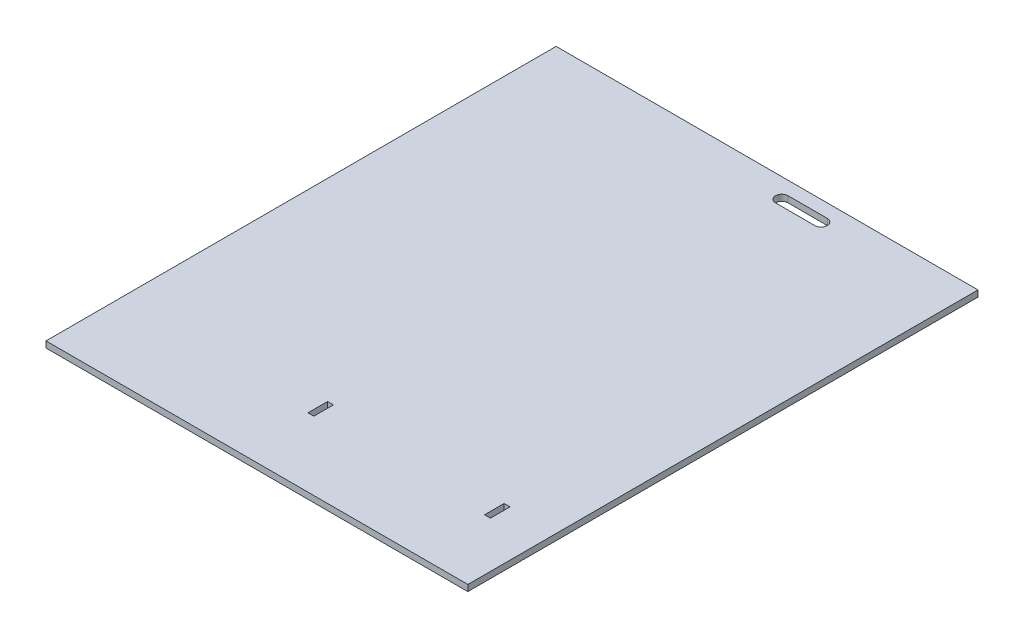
ISO-10303-21;
HEADER;
FILE_DESCRIPTION(('STEP AP214'),'2;1');
FILE_NAME('part.step','',(''),(''),'','','');
FILE_SCHEMA(('AUTOMOTIVE_DESIGN { 1 0 10303 214 1 1 1 1 }'));
ENDSEC;
DATA;
#1=APPLICATION_CONTEXT('core data for automotive mechanical design processes');
#2=APPLICATION_PROTOCOL_DEFINITION('international standard','automotive_design',2000,#1);
#3=PRODUCT_CONTEXT('',#1,'mechanical');
#4=PRODUCT('Part','Part','',(#3));
#5=PRODUCT_RELATED_PRODUCT_CATEGORY('part','',(#4));
#6=PRODUCT_DEFINITION_FORMATION('','',#4);
#7=PRODUCT_DEFINITION_CONTEXT('part definition',#1,'design');
#8=PRODUCT_DEFINITION('design','',#6,#7);
#9=PRODUCT_DEFINITION_SHAPE('','',#8);
#10=(LENGTH_UNIT() NAMED_UNIT(*) SI_UNIT(.MILLI.,.METRE.));
#11=(NAMED_UNIT(*) PLANE_ANGLE_UNIT() SI_UNIT($,.RADIAN.));
#12=(NAMED_UNIT(*) SI_UNIT($,.STERADIAN.) SOLID_ANGLE_UNIT());
#13=UNCERTAINTY_MEASURE_WITH_UNIT(LENGTH_MEASURE(1.E-05),#10,'distance_accuracy_value','');
#14=(GEOMETRIC_REPRESENTATION_CONTEXT(3) GLOBAL_UNCERTAINTY_ASSIGNED_CONTEXT((#13)) GLOBAL_UNIT_ASSIGNED_CONTEXT((#10,
#11,#12)) REPRESENTATION_CONTEXT('',''));
#15=CARTESIAN_POINT('',(0.,0.,0.));
#16=DIRECTION('',(0.,0.,1.));
#17=DIRECTION('',(1.,0.,0.));
#18=AXIS2_PLACEMENT_3D('',#15,#16,#17);
#19=CARTESIAN_POINT('',(0.,3.175,0.));
#20=DIRECTION('',(0.,1.,0.));
#21=DIRECTION('',(0.,0.,1.));
#22=AXIS2_PLACEMENT_3D('',#19,#20,#21);
#23=PLANE('',#22);
#24=DIRECTION('',(-1.,0.,0.));
#25=VECTOR('',#24,1.);
#26=CARTESIAN_POINT('',(23.5,3.175,-161.923484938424));
#27=LINE('',#26,#25);
#28=CARTESIAN_POINT('',(70.,3.175,-161.923484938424));
#29=VERTEX_POINT('',#28);
#30=CARTESIAN_POINT('',(-145.,3.175,-161.923484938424));
#31=VERTEX_POINT('',#30);
#32=EDGE_CURVE('E243',#29,#31,#27,.T.);
#33=ORIENTED_EDGE('',*,*,#32,.T.);
#34=DIRECTION('',(0.,0.,1.));
#35=VECTOR('',#34,1.);
#36=CARTESIAN_POINT('',(-145.,3.175,50.));
#37=LINE('',#36,#35);
#38=CARTESIAN_POINT('',(-145.,3.175,98.0765150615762));
#39=VERTEX_POINT('',#38);
#40=EDGE_CURVE('E245',#31,#39,#37,.T.);
#41=ORIENTED_EDGE('',*,*,#40,.T.);
#42=DIRECTION('',(1.,0.,0.));
#43=VECTOR('',#42,1.);
#44=CARTESIAN_POINT('',(-145.,3.175,98.0765150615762));
#45=LINE('',#44,#43);
#46=CARTESIAN_POINT('',(70.,3.175,98.0765150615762));
#47=VERTEX_POINT('',#46);
#48=EDGE_CURVE('E248',#39,#47,#45,.T.);
#49=ORIENTED_EDGE('',*,*,#48,.T.);
#50=DIRECTION('',(0.,0.,-1.));
#51=VECTOR('',#50,1.);
#52=CARTESIAN_POINT('',(70.,3.175,98.0765150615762));
#53=LINE('',#52,#51);
#54=EDGE_CURVE('E250',#47,#29,#53,.T.);
#55=ORIENTED_EDGE('',*,*,#54,.T.);
#56=EDGE_LOOP('',(#33,#41,#49,#55));
#57=FACE_BOUND('',#56,.T.);
#58=DIRECTION('',(1.,0.,0.));
#59=VECTOR('',#58,1.);
#60=CARTESIAN_POINT('',(-46.4986,3.175,63.0765150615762));
#61=LINE('',#60,#59);
#62=CARTESIAN_POINT('',(-46.4986,3.175,63.0765150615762));
#63=VERTEX_POINT('',#62);
#64=CARTESIAN_POINT('',(-43.5014,3.175,63.0765150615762));
#65=VERTEX_POINT('',#64);
#66=EDGE_CURVE('E214',#63,#65,#61,.T.);
#67=ORIENTED_EDGE('',*,*,#66,.F.);
#68=DIRECTION('',(0.,0.,1.));
#69=VECTOR('',#68,1.);
#70=CARTESIAN_POINT('',(-46.4986,3.175,53.0765150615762));
#71=LINE('',#70,#69);
#72=CARTESIAN_POINT('',(-46.4986,3.175,53.0765150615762));
#73=VERTEX_POINT('',#72);
#74=EDGE_CURVE('E212',#73,#63,#71,.T.);
#75=ORIENTED_EDGE('',*,*,#74,.F.);
#76=DIRECTION('',(-1.,0.,0.));
#77=VECTOR('',#76,1.);
#78=CARTESIAN_POINT('',(-46.4986,3.175,53.0765150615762));
#79=LINE('',#78,#77);
#80=CARTESIAN_POINT('',(-43.5014,3.175,53.0765150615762));
#81=VERTEX_POINT('',#80);
#82=EDGE_CURVE('E220',#81,#73,#79,.T.);
#83=ORIENTED_EDGE('',*,*,#82,.F.);
#84=DIRECTION('',(0.,0.,-1.));
#85=VECTOR('',#84,1.);
#86=CARTESIAN_POINT('',(-43.5014,3.175,53.0765150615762));
#87=LINE('',#86,#85);
#88=EDGE_CURVE('E217',#65,#81,#87,.T.);
#89=ORIENTED_EDGE('',*,*,#88,.F.);
#90=EDGE_LOOP('',(#67,#75,#83,#89));
#91=FACE_BOUND('',#90,.T.);
#92=DIRECTION('',(1.,0.,0.));
#93=VECTOR('',#92,1.);
#94=CARTESIAN_POINT('',(43.5014,3.175,63.0765150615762));
#95=LINE('',#94,#93);
#96=CARTESIAN_POINT('',(43.5014,3.175,63.0765150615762));
#97=VERTEX_POINT('',#96);
#98=CARTESIAN_POINT('',(46.4986,3.175,63.0765150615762));
#99=VERTEX_POINT('',#98);
#100=EDGE_CURVE('E183',#97,#99,#95,.T.);
#101=ORIENTED_EDGE('',*,*,#100,.F.);
#102=DIRECTION('',(0.,0.,1.));
#103=VECTOR('',#102,1.);
#104=CARTESIAN_POINT('',(43.5014,3.175,53.0765150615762));
#105=LINE('',#104,#103);
#106=CARTESIAN_POINT('',(43.5014,3.175,53.0765150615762));
#107=VERTEX_POINT('',#106);
#108=EDGE_CURVE('E181',#107,#97,#105,.T.);
#109=ORIENTED_EDGE('',*,*,#108,.F.);
#110=DIRECTION('',(-1.,0.,0.));
#111=VECTOR('',#110,1.);
#112=CARTESIAN_POINT('',(43.5014,3.175,53.0765150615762));
#113=LINE('',#112,#111);
#114=CARTESIAN_POINT('',(46.4986,3.175,53.0765150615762));
#115=VERTEX_POINT('',#114);
#116=EDGE_CURVE('E189',#115,#107,#113,.T.);
#117=ORIENTED_EDGE('',*,*,#116,.F.);
#118=DIRECTION('',(0.,0.,-1.));
#119=VECTOR('',#118,1.);
#120=CARTESIAN_POINT('',(46.4986,3.175,53.0765150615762));
#121=LINE('',#120,#119);
#122=EDGE_CURVE('E186',#99,#115,#121,.T.);
#123=ORIENTED_EDGE('',*,*,#122,.F.);
#124=EDGE_LOOP('',(#101,#109,#117,#123));
#125=FACE_BOUND('',#124,.T.);
#126=DIRECTION('',(1.,0.,0.));
#127=VECTOR('',#126,1.);
#128=CARTESIAN_POINT('',(-20.,3.175,-148.748484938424));
#129=LINE('',#128,#127);
#130=CARTESIAN_POINT('',(-20.,3.175,-148.748484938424));
#131=VERTEX_POINT('',#130);
#132=CARTESIAN_POINT('',(0.,3.175,-148.748484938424));
#133=VERTEX_POINT('',#132);
#134=EDGE_CURVE('E153',#131,#133,#129,.T.);
#135=ORIENTED_EDGE('',*,*,#134,.F.);
#136=CARTESIAN_POINT('',(-20.,3.175,-151.923484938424));
#137=DIRECTION('',(0.,1.,0.));
#138=DIRECTION('',(0.,0.,1.));
#139=AXIS2_PLACEMENT_3D('',#136,#137,#138);
#140=CIRCLE('',#139,3.17500000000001);
#141=CARTESIAN_POINT('',(-20.,3.175,-155.098484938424));
#142=VERTEX_POINT('',#141);
#143=EDGE_CURVE('E145',#142,#131,#140,.T.);
#144=ORIENTED_EDGE('',*,*,#143,.F.);
#145=DIRECTION('',(-1.,0.,0.));
#146=VECTOR('',#145,1.);
#147=CARTESIAN_POINT('',(-20.,3.175,-155.098484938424));
#148=LINE('',#147,#146);
#149=CARTESIAN_POINT('',(0.,3.175,-155.098484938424));
#150=VERTEX_POINT('',#149);
#151=EDGE_CURVE('E167',#150,#142,#148,.T.);
#152=ORIENTED_EDGE('',*,*,#151,.F.);
#153=CARTESIAN_POINT('',(0.,3.175,-151.923484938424));
#154=DIRECTION('',(0.,1.,0.));
#155=DIRECTION('',(0.,0.,1.));
#156=AXIS2_PLACEMENT_3D('',#153,#154,#155);
#157=CIRCLE('',#156,3.17500000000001);
#158=EDGE_CURVE('E165',#133,#150,#157,.T.);
#159=ORIENTED_EDGE('',*,*,#158,.F.);
#160=EDGE_LOOP('',(#135,#144,#152,#159));
#161=FACE_BOUND('',#160,.T.);
#162=ADVANCED_FACE('F32',(#57,#91,#125,#161),#23,.T.);
#163=CARTESIAN_POINT('',(0.,0.,0.));
#164=DIRECTION('',(0.,1.,0.));
#165=DIRECTION('',(0.,0.,1.));
#166=AXIS2_PLACEMENT_3D('',#163,#164,#165);
#167=PLANE('',#166);
#168=DIRECTION('',(0.,0.,1.));
#169=VECTOR('',#168,1.);
#170=CARTESIAN_POINT('',(43.5014,0.,53.0765150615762));
#171=LINE('',#170,#169);
#172=CARTESIAN_POINT('',(43.5014,0.,53.0765150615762));
#173=VERTEX_POINT('',#172);
#174=CARTESIAN_POINT('',(43.5014,0.,63.0765150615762));
#175=VERTEX_POINT('',#174);
#176=EDGE_CURVE('E161',#173,#175,#171,.T.);
#177=ORIENTED_EDGE('',*,*,#176,.T.);
#178=DIRECTION('',(1.,0.,0.));
#179=VECTOR('',#178,1.);
#180=CARTESIAN_POINT('',(43.5014,0.,63.0765150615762));
#181=LINE('',#180,#179);
#182=CARTESIAN_POINT('',(46.4986,0.,63.0765150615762));
#183=VERTEX_POINT('',#182);
#184=EDGE_CURVE('E194',#175,#183,#181,.T.);
#185=ORIENTED_EDGE('',*,*,#184,.T.);
#186=DIRECTION('',(0.,0.,-1.));
#187=VECTOR('',#186,1.);
#188=CARTESIAN_POINT('',(46.4986,0.,53.0765150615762));
#189=LINE('',#188,#187);
#190=CARTESIAN_POINT('',(46.4986,0.,53.0765150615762));
#191=VERTEX_POINT('',#190);
#192=EDGE_CURVE('E197',#183,#191,#189,.T.);
#193=ORIENTED_EDGE('',*,*,#192,.T.);
#194=DIRECTION('',(-1.,0.,0.));
#195=VECTOR('',#194,1.);
#196=CARTESIAN_POINT('',(43.5014,0.,53.0765150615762));
#197=LINE('',#196,#195);
#198=EDGE_CURVE('E184',#191,#173,#197,.T.);
#199=ORIENTED_EDGE('',*,*,#198,.T.);
#200=EDGE_LOOP('',(#177,#185,#193,#199));
#201=FACE_BOUND('',#200,.T.);
#202=DIRECTION('',(-1.,0.,0.));
#203=VECTOR('',#202,1.);
#204=CARTESIAN_POINT('',(-145.,0.,-161.923484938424));
#205=LINE('',#204,#203);
#206=CARTESIAN_POINT('',(70.,0.,-161.923484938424));
#207=VERTEX_POINT('',#206);
#208=CARTESIAN_POINT('',(-145.,0.,-161.923484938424));
#209=VERTEX_POINT('',#208);
#210=EDGE_CURVE('E242',#207,#209,#205,.T.);
#211=ORIENTED_EDGE('',*,*,#210,.F.);
#212=DIRECTION('',(0.,0.,-1.));
#213=VECTOR('',#212,1.);
#214=CARTESIAN_POINT('',(70.0000000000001,0.,50.));
#215=LINE('',#214,#213);
#216=CARTESIAN_POINT('',(70.,0.,98.0765150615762));
#217=VERTEX_POINT('',#216);
#218=EDGE_CURVE('E246',#217,#207,#215,.T.);
#219=ORIENTED_EDGE('',*,*,#218,.F.);
#220=DIRECTION('',(1.,0.,0.));
#221=VECTOR('',#220,1.);
#222=CARTESIAN_POINT('',(-145.,0.,98.0765150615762));
#223=LINE('',#222,#221);
#224=CARTESIAN_POINT('',(-145.,0.,98.0765150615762));
#225=VERTEX_POINT('',#224);
#226=EDGE_CURVE('E257',#225,#217,#223,.T.);
#227=ORIENTED_EDGE('',*,*,#226,.F.);
#228=DIRECTION('',(0.,0.,1.));
#229=VECTOR('',#228,1.);
#230=CARTESIAN_POINT('',(-145.,0.,98.0765150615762));
#231=LINE('',#230,#229);
#232=EDGE_CURVE('E255',#209,#225,#231,.T.);
#233=ORIENTED_EDGE('',*,*,#232,.F.);
#234=EDGE_LOOP('',(#211,#219,#227,#233));
#235=FACE_BOUND('',#234,.T.);
#236=DIRECTION('',(0.,0.,1.));
#237=VECTOR('',#236,1.);
#238=CARTESIAN_POINT('',(-46.4986,0.,53.0765150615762));
#239=LINE('',#238,#237);
#240=CARTESIAN_POINT('',(-46.4986,0.,53.0765150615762));
#241=VERTEX_POINT('',#240);
#242=CARTESIAN_POINT('',(-46.4986,0.,63.0765150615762));
#243=VERTEX_POINT('',#242);
#244=EDGE_CURVE('E211',#241,#243,#239,.T.);
#245=ORIENTED_EDGE('',*,*,#244,.T.);
#246=DIRECTION('',(1.,0.,0.));
#247=VECTOR('',#246,1.);
#248=CARTESIAN_POINT('',(-46.4986,0.,63.0765150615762));
#249=LINE('',#248,#247);
#250=CARTESIAN_POINT('',(-43.5014,0.,63.0765150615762));
#251=VERTEX_POINT('',#250);
#252=EDGE_CURVE('E225',#243,#251,#249,.T.);
#253=ORIENTED_EDGE('',*,*,#252,.T.);
#254=DIRECTION('',(0.,0.,-1.));
#255=VECTOR('',#254,1.);
#256=CARTESIAN_POINT('',(-43.5014,0.,53.0765150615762));
#257=LINE('',#256,#255);
#258=CARTESIAN_POINT('',(-43.5014,0.,53.0765150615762));
#259=VERTEX_POINT('',#258);
#260=EDGE_CURVE('E228',#251,#259,#257,.T.);
#261=ORIENTED_EDGE('',*,*,#260,.T.);
#262=DIRECTION('',(-1.,0.,0.));
#263=VECTOR('',#262,1.);
#264=CARTESIAN_POINT('',(-46.4986,0.,53.0765150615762));
#265=LINE('',#264,#263);
#266=EDGE_CURVE('E215',#259,#241,#265,.T.);
#267=ORIENTED_EDGE('',*,*,#266,.T.);
#268=EDGE_LOOP('',(#245,#253,#261,#267));
#269=FACE_BOUND('',#268,.T.);
#270=CARTESIAN_POINT('',(-20.,0.,-151.923484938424));
#271=DIRECTION('',(0.,1.,0.));
#272=DIRECTION('',(0.,0.,1.));
#273=AXIS2_PLACEMENT_3D('',#270,#271,#272);
#274=CIRCLE('',#273,3.17500000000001);
#275=CARTESIAN_POINT('',(-20.,0.,-155.098484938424));
#276=VERTEX_POINT('',#275);
#277=CARTESIAN_POINT('',(-20.,0.,-148.748484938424));
#278=VERTEX_POINT('',#277);
#279=EDGE_CURVE('E55',#276,#278,#274,.T.);
#280=ORIENTED_EDGE('',*,*,#279,.T.);
#281=DIRECTION('',(1.,0.,0.));
#282=VECTOR('',#281,1.);
#283=CARTESIAN_POINT('',(-20.,0.,-148.748484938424));
#284=LINE('',#283,#282);
#285=CARTESIAN_POINT('',(0.,0.,-148.748484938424));
#286=VERTEX_POINT('',#285);
#287=EDGE_CURVE('E160',#278,#286,#284,.T.);
#288=ORIENTED_EDGE('',*,*,#287,.T.);
#289=CARTESIAN_POINT('',(0.,0.,-151.923484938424));
#290=DIRECTION('',(0.,1.,0.));
#291=DIRECTION('',(0.,0.,1.));
#292=AXIS2_PLACEMENT_3D('',#289,#290,#291);
#293=CIRCLE('',#292,3.17500000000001);
#294=CARTESIAN_POINT('',(0.,0.,-155.098484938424));
#295=VERTEX_POINT('',#294);
#296=EDGE_CURVE('E173',#286,#295,#293,.T.);
#297=ORIENTED_EDGE('',*,*,#296,.T.);
#298=DIRECTION('',(-1.,0.,0.));
#299=VECTOR('',#298,1.);
#300=CARTESIAN_POINT('',(-20.,0.,-155.098484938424));
#301=LINE('',#300,#299);
#302=EDGE_CURVE('E154',#295,#276,#301,.T.);
#303=ORIENTED_EDGE('',*,*,#302,.T.);
#304=EDGE_LOOP('',(#280,#288,#297,#303));
#305=FACE_BOUND('',#304,.T.);
#306=ADVANCED_FACE('F276',(#201,#235,#269,#305),#167,.F.);
#307=CARTESIAN_POINT('',(-145.,3.175,-161.923484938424));
#308=DIRECTION('',(0.,0.,1.));
#309=DIRECTION('',(1.,0.,0.));
#310=AXIS2_PLACEMENT_3D('',#307,#308,#309);
#311=PLANE('',#310);
#312=ORIENTED_EDGE('',*,*,#210,.T.);
#313=DIRECTION('',(0.,-1.,0.));
#314=VECTOR('',#313,1.);
#315=CARTESIAN_POINT('',(-145.,3.175,-161.923484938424));
#316=LINE('',#315,#314);
#317=EDGE_CURVE('E11',#31,#209,#316,.T.);
#318=ORIENTED_EDGE('',*,*,#317,.F.);
#319=ORIENTED_EDGE('',*,*,#32,.F.);
#320=DIRECTION('',(0.,-1.,0.));
#321=VECTOR('',#320,1.);
#322=CARTESIAN_POINT('',(70.,3.175,-161.923484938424));
#323=LINE('',#322,#321);
#324=EDGE_CURVE('E252',#29,#207,#323,.T.);
#325=ORIENTED_EDGE('',*,*,#324,.T.);
#326=EDGE_LOOP('',(#312,#318,#319,#325));
#327=FACE_BOUND('',#326,.T.);
#328=ADVANCED_FACE('F34',(#327),#311,.F.);
#329=CARTESIAN_POINT('',(-145.,3.175,98.0765150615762));
#330=DIRECTION('',(1.,0.,0.));
#331=DIRECTION('',(0.,0.,-1.));
#332=AXIS2_PLACEMENT_3D('',#329,#330,#331);
#333=PLANE('',#332);
#334=ORIENTED_EDGE('',*,*,#232,.T.);
#335=DIRECTION('',(0.,-1.,0.));
#336=VECTOR('',#335,1.);
#337=CARTESIAN_POINT('',(-145.,3.175,98.0765150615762));
#338=LINE('',#337,#336);
#339=EDGE_CURVE('E40',#39,#225,#338,.T.);
#340=ORIENTED_EDGE('',*,*,#339,.F.);
#341=ORIENTED_EDGE('',*,*,#40,.F.);
#342=ORIENTED_EDGE('',*,*,#317,.T.);
#343=EDGE_LOOP('',(#334,#340,#341,#342));
#344=FACE_BOUND('',#343,.T.);
#345=ADVANCED_FACE('F287',(#344),#333,.F.);
#346=CARTESIAN_POINT('',(-145.,3.175,98.0765150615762));
#347=DIRECTION('',(0.,0.,-1.));
#348=DIRECTION('',(-1.,0.,0.));
#349=AXIS2_PLACEMENT_3D('',#346,#347,#348);
#350=PLANE('',#349);
#351=ORIENTED_EDGE('',*,*,#226,.T.);
#352=DIRECTION('',(0.,-1.,0.));
#353=VECTOR('',#352,1.);
#354=CARTESIAN_POINT('',(70.,3.175,98.0765150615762));
#355=LINE('',#354,#353);
#356=EDGE_CURVE('E264',#47,#217,#355,.T.);
#357=ORIENTED_EDGE('',*,*,#356,.F.);
#358=ORIENTED_EDGE('',*,*,#48,.F.);
#359=ORIENTED_EDGE('',*,*,#339,.T.);
#360=EDGE_LOOP('',(#351,#357,#358,#359));
#361=FACE_BOUND('',#360,.T.);
#362=ADVANCED_FACE('F271',(#361),#350,.F.);
#363=CARTESIAN_POINT('',(70.0000000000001,3.175,50.));
#364=DIRECTION('',(-1.,0.,0.));
#365=DIRECTION('',(0.,0.,1.));
#366=AXIS2_PLACEMENT_3D('',#363,#364,#365);
#367=PLANE('',#366);
#368=ORIENTED_EDGE('',*,*,#218,.T.);
#369=ORIENTED_EDGE('',*,*,#324,.F.);
#370=ORIENTED_EDGE('',*,*,#54,.F.);
#371=ORIENTED_EDGE('',*,*,#356,.T.);
#372=EDGE_LOOP('',(#368,#369,#370,#371));
#373=FACE_BOUND('',#372,.T.);
#374=ADVANCED_FACE('F280',(#373),#367,.F.);
#375=CARTESIAN_POINT('',(-46.4986,3.175,53.0765150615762));
#376=DIRECTION('',(1.,0.,0.));
#377=DIRECTION('',(0.,0.,-1.));
#378=AXIS2_PLACEMENT_3D('',#375,#376,#377);
#379=PLANE('',#378);
#380=ORIENTED_EDGE('',*,*,#244,.F.);
#381=DIRECTION('',(0.,-1.,0.));
#382=VECTOR('',#381,1.);
#383=CARTESIAN_POINT('',(-46.4986,3.175,53.0765150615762));
#384=LINE('',#383,#382);
#385=EDGE_CURVE('E222',#73,#241,#384,.T.);
#386=ORIENTED_EDGE('',*,*,#385,.F.);
#387=ORIENTED_EDGE('',*,*,#74,.T.);
#388=DIRECTION('',(0.,-1.,0.));
#389=VECTOR('',#388,1.);
#390=CARTESIAN_POINT('',(-46.4986,3.175,63.0765150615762));
#391=LINE('',#390,#389);
#392=EDGE_CURVE('E239',#63,#243,#391,.T.);
#393=ORIENTED_EDGE('',*,*,#392,.T.);
#394=EDGE_LOOP('',(#380,#386,#387,#393));
#395=FACE_BOUND('',#394,.T.);
#396=ADVANCED_FACE('F302',(#395),#379,.T.);
#397=CARTESIAN_POINT('',(-46.4986,3.175,63.0765150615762));
#398=DIRECTION('',(0.,0.,-1.));
#399=DIRECTION('',(-1.,0.,0.));
#400=AXIS2_PLACEMENT_3D('',#397,#398,#399);
#401=PLANE('',#400);
#402=ORIENTED_EDGE('',*,*,#252,.F.);
#403=ORIENTED_EDGE('',*,*,#392,.F.);
#404=ORIENTED_EDGE('',*,*,#66,.T.);
#405=DIRECTION('',(0.,-1.,0.));
#406=VECTOR('',#405,1.);
#407=CARTESIAN_POINT('',(-43.5014,3.175,63.0765150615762));
#408=LINE('',#407,#406);
#409=EDGE_CURVE('E237',#65,#251,#408,.T.);
#410=ORIENTED_EDGE('',*,*,#409,.T.);
#411=EDGE_LOOP('',(#402,#403,#404,#410));
#412=FACE_BOUND('',#411,.T.);
#413=ADVANCED_FACE('F309',(#412),#401,.T.);
#414=CARTESIAN_POINT('',(-43.5014,3.175,53.0765150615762));
#415=DIRECTION('',(-1.,0.,0.));
#416=DIRECTION('',(0.,0.,1.));
#417=AXIS2_PLACEMENT_3D('',#414,#415,#416);
#418=PLANE('',#417);
#419=ORIENTED_EDGE('',*,*,#260,.F.);
#420=ORIENTED_EDGE('',*,*,#409,.F.);
#421=ORIENTED_EDGE('',*,*,#88,.T.);
#422=DIRECTION('',(0.,-1.,0.));
#423=VECTOR('',#422,1.);
#424=CARTESIAN_POINT('',(-43.5014,3.175,53.0765150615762));
#425=LINE('',#424,#423);
#426=EDGE_CURVE('E235',#81,#259,#425,.T.);
#427=ORIENTED_EDGE('',*,*,#426,.T.);
#428=EDGE_LOOP('',(#419,#420,#421,#427));
#429=FACE_BOUND('',#428,.T.);
#430=ADVANCED_FACE('F314',(#429),#418,.T.);
#431=CARTESIAN_POINT('',(-46.4986,3.175,53.0765150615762));
#432=DIRECTION('',(0.,0.,1.));
#433=DIRECTION('',(1.,0.,0.));
#434=AXIS2_PLACEMENT_3D('',#431,#432,#433);
#435=PLANE('',#434);
#436=ORIENTED_EDGE('',*,*,#266,.F.);
#437=ORIENTED_EDGE('',*,*,#426,.F.);
#438=ORIENTED_EDGE('',*,*,#82,.T.);
#439=ORIENTED_EDGE('',*,*,#385,.T.);
#440=EDGE_LOOP('',(#436,#437,#438,#439));
#441=FACE_BOUND('',#440,.T.);
#442=ADVANCED_FACE('F321',(#441),#435,.T.);
#443=CARTESIAN_POINT('',(43.5014,3.175,53.0765150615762));
#444=DIRECTION('',(1.,0.,0.));
#445=DIRECTION('',(0.,0.,-1.));
#446=AXIS2_PLACEMENT_3D('',#443,#444,#445);
#447=PLANE('',#446);
#448=ORIENTED_EDGE('',*,*,#176,.F.);
#449=DIRECTION('',(0.,-1.,0.));
#450=VECTOR('',#449,1.);
#451=CARTESIAN_POINT('',(43.5014,3.175,53.0765150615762));
#452=LINE('',#451,#450);
#453=EDGE_CURVE('E191',#107,#173,#452,.T.);
#454=ORIENTED_EDGE('',*,*,#453,.F.);
#455=ORIENTED_EDGE('',*,*,#108,.T.);
#456=DIRECTION('',(0.,-1.,0.));
#457=VECTOR('',#456,1.);
#458=CARTESIAN_POINT('',(43.5014,3.175,63.0765150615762));
#459=LINE('',#458,#457);
#460=EDGE_CURVE('E208',#97,#175,#459,.T.);
#461=ORIENTED_EDGE('',*,*,#460,.T.);
#462=EDGE_LOOP('',(#448,#454,#455,#461));
#463=FACE_BOUND('',#462,.T.);
#464=ADVANCED_FACE('F343',(#463),#447,.T.);
#465=CARTESIAN_POINT('',(43.5014,3.175,63.0765150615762));
#466=DIRECTION('',(0.,0.,-1.));
#467=DIRECTION('',(-1.,0.,0.));
#468=AXIS2_PLACEMENT_3D('',#465,#466,#467);
#469=PLANE('',#468);
#470=ORIENTED_EDGE('',*,*,#184,.F.);
#471=ORIENTED_EDGE('',*,*,#460,.F.);
#472=ORIENTED_EDGE('',*,*,#100,.T.);
#473=DIRECTION('',(0.,-1.,0.));
#474=VECTOR('',#473,1.);
#475=CARTESIAN_POINT('',(46.4986,3.175,63.0765150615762));
#476=LINE('',#475,#474);
#477=EDGE_CURVE('E206',#99,#183,#476,.T.);
#478=ORIENTED_EDGE('',*,*,#477,.T.);
#479=EDGE_LOOP('',(#470,#471,#472,#478));
#480=FACE_BOUND('',#479,.T.);
#481=ADVANCED_FACE('F337',(#480),#469,.T.);
#482=CARTESIAN_POINT('',(46.4986,3.175,53.0765150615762));
#483=DIRECTION('',(-1.,0.,0.));
#484=DIRECTION('',(0.,0.,1.));
#485=AXIS2_PLACEMENT_3D('',#482,#483,#484);
#486=PLANE('',#485);
#487=ORIENTED_EDGE('',*,*,#192,.F.);
#488=ORIENTED_EDGE('',*,*,#477,.F.);
#489=ORIENTED_EDGE('',*,*,#122,.T.);
#490=DIRECTION('',(0.,-1.,0.));
#491=VECTOR('',#490,1.);
#492=CARTESIAN_POINT('',(46.4986,3.175,53.0765150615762));
#493=LINE('',#492,#491);
#494=EDGE_CURVE('E204',#115,#191,#493,.T.);
#495=ORIENTED_EDGE('',*,*,#494,.T.);
#496=EDGE_LOOP('',(#487,#488,#489,#495));
#497=FACE_BOUND('',#496,.T.);
#498=ADVANCED_FACE('F340',(#497),#486,.T.);
#499=CARTESIAN_POINT('',(43.5014,3.175,53.0765150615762));
#500=DIRECTION('',(0.,0.,1.));
#501=DIRECTION('',(1.,0.,0.));
#502=AXIS2_PLACEMENT_3D('',#499,#500,#501);
#503=PLANE('',#502);
#504=ORIENTED_EDGE('',*,*,#198,.F.);
#505=ORIENTED_EDGE('',*,*,#494,.F.);
#506=ORIENTED_EDGE('',*,*,#116,.T.);
#507=ORIENTED_EDGE('',*,*,#453,.T.);
#508=EDGE_LOOP('',(#504,#505,#506,#507));
#509=FACE_BOUND('',#508,.T.);
#510=ADVANCED_FACE('F346',(#509),#503,.T.);
#511=CARTESIAN_POINT('',(-20.,3.175,-151.923484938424));
#512=DIRECTION('',(0.,-1.,0.));
#513=DIRECTION('',(0.,0.,-1.));
#514=AXIS2_PLACEMENT_3D('',#511,#512,#513);
#515=CYLINDRICAL_SURFACE('',#514,3.17500000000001);
#516=ORIENTED_EDGE('',*,*,#279,.F.);
#517=DIRECTION('',(0.,-1.,0.));
#518=VECTOR('',#517,1.);
#519=CARTESIAN_POINT('',(-20.,3.175,-155.098484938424));
#520=LINE('',#519,#518);
#521=EDGE_CURVE('E149',#142,#276,#520,.T.);
#522=ORIENTED_EDGE('',*,*,#521,.F.);
#523=ORIENTED_EDGE('',*,*,#143,.T.);
#524=DIRECTION('',(0.,-1.,0.));
#525=VECTOR('',#524,1.);
#526=CARTESIAN_POINT('',(-20.,3.175,-148.748484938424));
#527=LINE('',#526,#525);
#528=EDGE_CURVE('E148',#131,#278,#527,.T.);
#529=ORIENTED_EDGE('',*,*,#528,.T.);
#530=EDGE_LOOP('',(#516,#522,#523,#529));
#531=FACE_BOUND('',#530,.T.);
#532=ADVANCED_FACE('F147',(#531),#515,.F.);
#533=CARTESIAN_POINT('',(-20.,3.175,-148.748484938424));
#534=DIRECTION('',(0.,0.,-1.));
#535=DIRECTION('',(-1.,0.,0.));
#536=AXIS2_PLACEMENT_3D('',#533,#534,#535);
#537=PLANE('',#536);
#538=ORIENTED_EDGE('',*,*,#287,.F.);
#539=ORIENTED_EDGE('',*,*,#528,.F.);
#540=ORIENTED_EDGE('',*,*,#134,.T.);
#541=DIRECTION('',(0.,-1.,0.));
#542=VECTOR('',#541,1.);
#543=CARTESIAN_POINT('',(0.,3.175,-148.748484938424));
#544=LINE('',#543,#542);
#545=EDGE_CURVE('E162',#133,#286,#544,.T.);
#546=ORIENTED_EDGE('',*,*,#545,.T.);
#547=EDGE_LOOP('',(#538,#539,#540,#546));
#548=FACE_BOUND('',#547,.T.);
#549=ADVANCED_FACE('F157',(#548),#537,.T.);
#550=CARTESIAN_POINT('',(0.,3.175,-151.923484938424));
#551=DIRECTION('',(0.,-1.,0.));
#552=DIRECTION('',(0.,0.,-1.));
#553=AXIS2_PLACEMENT_3D('',#550,#551,#552);
#554=CYLINDRICAL_SURFACE('',#553,3.17500000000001);
#555=ORIENTED_EDGE('',*,*,#296,.F.);
#556=ORIENTED_EDGE('',*,*,#545,.F.);
#557=ORIENTED_EDGE('',*,*,#158,.T.);
#558=DIRECTION('',(0.,-1.,0.));
#559=VECTOR('',#558,1.);
#560=CARTESIAN_POINT('',(0.,3.175,-155.098484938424));
#561=LINE('',#560,#559);
#562=EDGE_CURVE('E47',#150,#295,#561,.T.);
#563=ORIENTED_EDGE('',*,*,#562,.T.);
#564=EDGE_LOOP('',(#555,#556,#557,#563));
#565=FACE_BOUND('',#564,.T.);
#566=ADVANCED_FACE('F403',(#565),#554,.F.);
#567=CARTESIAN_POINT('',(-20.,3.175,-155.098484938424));
#568=DIRECTION('',(0.,0.,1.));
#569=DIRECTION('',(1.,0.,0.));
#570=AXIS2_PLACEMENT_3D('',#567,#568,#569);
#571=PLANE('',#570);
#572=ORIENTED_EDGE('',*,*,#302,.F.);
#573=ORIENTED_EDGE('',*,*,#562,.F.);
#574=ORIENTED_EDGE('',*,*,#151,.T.);
#575=ORIENTED_EDGE('',*,*,#521,.T.);
#576=EDGE_LOOP('',(#572,#573,#574,#575));
#577=FACE_BOUND('',#576,.T.);
#578=ADVANCED_FACE('F411',(#577),#571,.T.);
#579=CLOSED_SHELL('',(#162,#306,#328,#345,#362,#374,#396,#413,#430,#442,#464,#481,#498,#510,
#532,#549,#566,#578));
#580=MANIFOLD_SOLID_BREP('B2',#579);
#581=ADVANCED_BREP_SHAPE_REPRESENTATION('',(#18,#580),#14);
#582=SHAPE_DEFINITION_REPRESENTATION(#9,#581);
ENDSEC;
END-ISO-10303-21;
